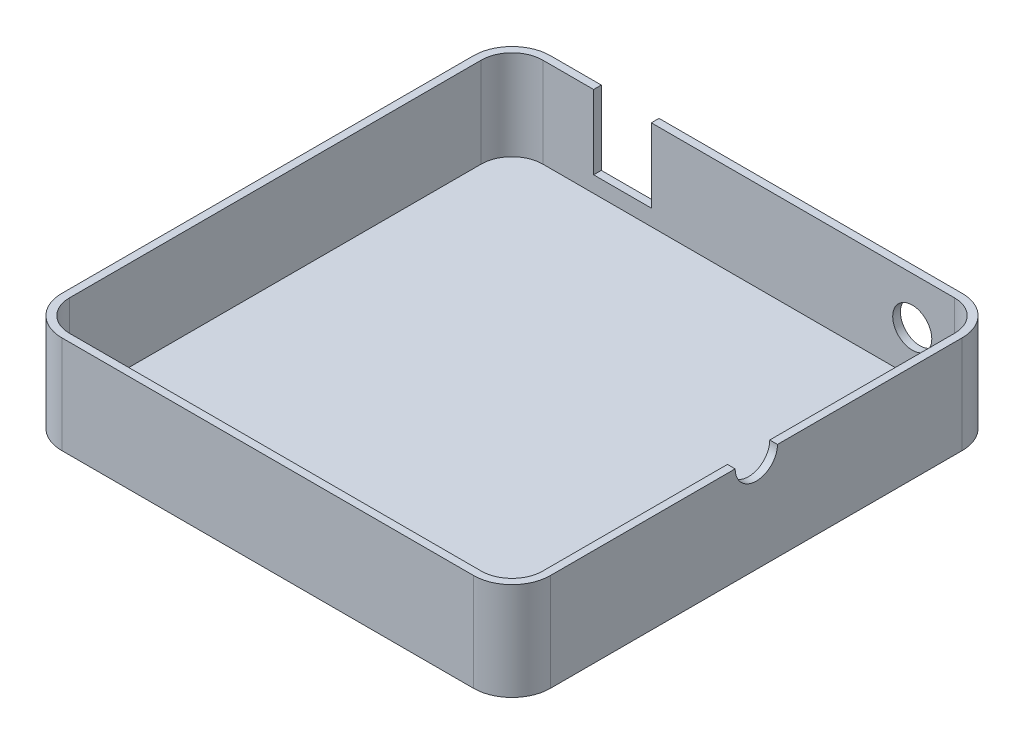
ISO-10303-21;
HEADER;
FILE_DESCRIPTION(('STEP AP214'),'2;1');
FILE_NAME('part.step','',(''),(''),'','','');
FILE_SCHEMA(('AUTOMOTIVE_DESIGN { 1 0 10303 214 1 1 1 1 }'));
ENDSEC;
DATA;
#1=APPLICATION_CONTEXT('core data for automotive mechanical design processes');
#2=APPLICATION_PROTOCOL_DEFINITION('international standard','automotive_design',2000,#1);
#3=PRODUCT_CONTEXT('',#1,'mechanical');
#4=PRODUCT('Part','Part','',(#3));
#5=PRODUCT_RELATED_PRODUCT_CATEGORY('part','',(#4));
#6=PRODUCT_DEFINITION_FORMATION('','',#4);
#7=PRODUCT_DEFINITION_CONTEXT('part definition',#1,'design');
#8=PRODUCT_DEFINITION('design','',#6,#7);
#9=PRODUCT_DEFINITION_SHAPE('','',#8);
#10=(LENGTH_UNIT() NAMED_UNIT(*) SI_UNIT(.MILLI.,.METRE.));
#11=(NAMED_UNIT(*) PLANE_ANGLE_UNIT() SI_UNIT($,.RADIAN.));
#12=(NAMED_UNIT(*) SI_UNIT($,.STERADIAN.) SOLID_ANGLE_UNIT());
#13=UNCERTAINTY_MEASURE_WITH_UNIT(LENGTH_MEASURE(1.E-05),#10,'distance_accuracy_value','');
#14=(GEOMETRIC_REPRESENTATION_CONTEXT(3) GLOBAL_UNCERTAINTY_ASSIGNED_CONTEXT((#13)) GLOBAL_UNIT_ASSIGNED_CONTEXT((#10,
#11,#12)) REPRESENTATION_CONTEXT('',''));
#15=CARTESIAN_POINT('',(0.,0.,0.));
#16=DIRECTION('',(0.,0.,1.));
#17=DIRECTION('',(1.,0.,0.));
#18=AXIS2_PLACEMENT_3D('',#15,#16,#17);
#19=CARTESIAN_POINT('',(0.,0.,127.));
#20=DIRECTION('',(0.,-1.,0.));
#21=DIRECTION('',(0.,0.,-1.));
#22=AXIS2_PLACEMENT_3D('',#19,#20,#21);
#23=PLANE('',#22);
#24=DIRECTION('',(-1.,0.,0.));
#25=VECTOR('',#24,1.);
#26=CARTESIAN_POINT('',(0.,0.,2.));
#27=LINE('',#26,#25);
#28=CARTESIAN_POINT('',(23.214826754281,0.,2.));
#29=VERTEX_POINT('',#28);
#30=CARTESIAN_POINT('',(10.,0.,2.));
#31=VERTEX_POINT('',#30);
#32=EDGE_CURVE('E203',#29,#31,#27,.T.);
#33=ORIENTED_EDGE('',*,*,#32,.F.);
#34=DIRECTION('',(0.,0.,1.));
#35=VECTOR('',#34,1.);
#36=CARTESIAN_POINT('',(23.214826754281,0.,127.001));
#37=LINE('',#36,#35);
#38=CARTESIAN_POINT('',(23.214826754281,0.,0.));
#39=VERTEX_POINT('',#38);
#40=EDGE_CURVE('E188',#39,#29,#37,.T.);
#41=ORIENTED_EDGE('',*,*,#40,.F.);
#42=DIRECTION('',(-1.,0.,0.));
#43=VECTOR('',#42,1.);
#44=CARTESIAN_POINT('',(0.,0.,0.));
#45=LINE('',#44,#43);
#46=CARTESIAN_POINT('',(10.,0.,0.));
#47=VERTEX_POINT('',#46);
#48=EDGE_CURVE('E200',#39,#47,#45,.T.);
#49=ORIENTED_EDGE('',*,*,#48,.T.);
#50=CARTESIAN_POINT('',(10.,0.,9.99999999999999));
#51=DIRECTION('',(0.,-1.,0.));
#52=DIRECTION('',(0.,0.,-1.));
#53=AXIS2_PLACEMENT_3D('',#50,#51,#52);
#54=CIRCLE('',#53,10.);
#55=CARTESIAN_POINT('',(0.,0.,9.99999999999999));
#56=VERTEX_POINT('',#55);
#57=EDGE_CURVE('E254',#47,#56,#54,.F.);
#58=ORIENTED_EDGE('',*,*,#57,.T.);
#59=DIRECTION('',(0.,0.,-1.));
#60=VECTOR('',#59,1.);
#61=CARTESIAN_POINT('',(0.,0.,127.));
#62=LINE('',#61,#60);
#63=CARTESIAN_POINT('',(0.,0.,117.));
#64=VERTEX_POINT('',#63);
#65=EDGE_CURVE('E221',#64,#56,#62,.T.);
#66=ORIENTED_EDGE('',*,*,#65,.F.);
#67=CARTESIAN_POINT('',(10.,0.,117.));
#68=DIRECTION('',(0.,-1.,0.));
#69=DIRECTION('',(0.,0.,-1.));
#70=AXIS2_PLACEMENT_3D('',#67,#68,#69);
#71=CIRCLE('',#70,10.);
#72=CARTESIAN_POINT('',(10.,0.,127.));
#73=VERTEX_POINT('',#72);
#74=EDGE_CURVE('E260',#64,#73,#71,.F.);
#75=ORIENTED_EDGE('',*,*,#74,.T.);
#76=DIRECTION('',(-1.,0.,0.));
#77=VECTOR('',#76,1.);
#78=CARTESIAN_POINT('',(0.,0.,127.));
#79=LINE('',#78,#77);
#80=CARTESIAN_POINT('',(117.,0.,127.));
#81=VERTEX_POINT('',#80);
#82=EDGE_CURVE('E225',#81,#73,#79,.T.);
#83=ORIENTED_EDGE('',*,*,#82,.F.);
#84=CARTESIAN_POINT('',(117.,0.,117.));
#85=DIRECTION('',(0.,-1.,0.));
#86=DIRECTION('',(0.,0.,-1.));
#87=AXIS2_PLACEMENT_3D('',#84,#85,#86);
#88=CIRCLE('',#87,10.);
#89=CARTESIAN_POINT('',(127.,0.,117.));
#90=VERTEX_POINT('',#89);
#91=EDGE_CURVE('E258',#81,#90,#88,.F.);
#92=ORIENTED_EDGE('',*,*,#91,.T.);
#93=DIRECTION('',(0.,0.,-1.));
#94=VECTOR('',#93,1.);
#95=CARTESIAN_POINT('',(127.,0.,127.));
#96=LINE('',#95,#94);
#97=CARTESIAN_POINT('',(127.,0.,69.));
#98=VERTEX_POINT('',#97);
#99=EDGE_CURVE('E226',#90,#98,#96,.T.);
#100=ORIENTED_EDGE('',*,*,#99,.T.);
#101=DIRECTION('',(1.,0.,0.));
#102=VECTOR('',#101,1.);
#103=CARTESIAN_POINT('',(123.,0.,69.));
#104=LINE('',#103,#102);
#105=CARTESIAN_POINT('',(125.,0.,69.));
#106=VERTEX_POINT('',#105);
#107=EDGE_CURVE('E419',#98,#106,#104,.F.);
#108=ORIENTED_EDGE('',*,*,#107,.T.);
#109=DIRECTION('',(0.,0.,-1.));
#110=VECTOR('',#109,1.);
#111=CARTESIAN_POINT('',(125.,0.,127.));
#112=LINE('',#111,#110);
#113=CARTESIAN_POINT('',(125.,0.,117.));
#114=VERTEX_POINT('',#113);
#115=EDGE_CURVE('E368',#114,#106,#112,.T.);
#116=ORIENTED_EDGE('',*,*,#115,.F.);
#117=CARTESIAN_POINT('',(117.,0.,117.));
#118=DIRECTION('',(0.,-1.,0.));
#119=DIRECTION('',(0.,0.,-1.));
#120=AXIS2_PLACEMENT_3D('',#117,#118,#119);
#121=CIRCLE('',#120,8.);
#122=CARTESIAN_POINT('',(117.,0.,125.));
#123=VERTEX_POINT('',#122);
#124=EDGE_CURVE('E367',#123,#114,#121,.F.);
#125=ORIENTED_EDGE('',*,*,#124,.F.);
#126=DIRECTION('',(-1.,0.,0.));
#127=VECTOR('',#126,1.);
#128=CARTESIAN_POINT('',(0.,0.,125.));
#129=LINE('',#128,#127);
#130=CARTESIAN_POINT('',(10.,0.,125.));
#131=VERTEX_POINT('',#130);
#132=EDGE_CURVE('E375',#123,#131,#129,.T.);
#133=ORIENTED_EDGE('',*,*,#132,.T.);
#134=CARTESIAN_POINT('',(10.,0.,117.));
#135=DIRECTION('',(0.,-1.,0.));
#136=DIRECTION('',(0.,0.,-1.));
#137=AXIS2_PLACEMENT_3D('',#134,#135,#136);
#138=CIRCLE('',#137,8.);
#139=CARTESIAN_POINT('',(2.,0.,117.));
#140=VERTEX_POINT('',#139);
#141=EDGE_CURVE('E374',#140,#131,#138,.F.);
#142=ORIENTED_EDGE('',*,*,#141,.F.);
#143=DIRECTION('',(0.,0.,-1.));
#144=VECTOR('',#143,1.);
#145=CARTESIAN_POINT('',(2.,0.,127.));
#146=LINE('',#145,#144);
#147=CARTESIAN_POINT('',(2.,0.,9.99999999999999));
#148=VERTEX_POINT('',#147);
#149=EDGE_CURVE('E378',#140,#148,#146,.T.);
#150=ORIENTED_EDGE('',*,*,#149,.T.);
#151=CARTESIAN_POINT('',(10.,0.,9.99999999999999));
#152=DIRECTION('',(0.,-1.,0.));
#153=DIRECTION('',(0.,0.,-1.));
#154=AXIS2_PLACEMENT_3D('',#151,#152,#153);
#155=CIRCLE('',#154,8.);
#156=EDGE_CURVE('E359',#31,#148,#155,.F.);
#157=ORIENTED_EDGE('',*,*,#156,.F.);
#158=EDGE_LOOP('',(#33,#41,#49,#58,#66,#75,#83,#92,#100,#108,#116,#125,#133,#142,#150,#157));
#159=FACE_BOUND('',#158,.T.);
#160=ADVANCED_FACE('F37',(#159),#23,.F.);
#161=CARTESIAN_POINT('',(0.,0.,127.));
#162=DIRECTION('',(1.,0.,0.));
#163=DIRECTION('',(0.,1.,0.));
#164=AXIS2_PLACEMENT_3D('',#161,#162,#163);
#165=PLANE('',#164);
#166=CARTESIAN_POINT('',(0.,-12.7181438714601,55.0759828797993));
#167=DIRECTION('',(1.,0.,0.));
#168=DIRECTION('',(0.,1.,0.));
#169=AXIS2_PLACEMENT_3D('',#166,#167,#168);
#170=CIRCLE('',#169,6.);
#171=CARTESIAN_POINT('',(0.,-6.71814387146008,55.0759828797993));
#172=VERTEX_POINT('',#171);
#173=EDGE_CURVE('E45',#172,#172,#170,.F.);
#174=ORIENTED_EDGE('',*,*,#173,.F.);
#175=EDGE_LOOP('',(#174));
#176=FACE_BOUND('',#175,.T.);
#177=DIRECTION('',(0.,0.,-1.));
#178=VECTOR('',#177,1.);
#179=CARTESIAN_POINT('',(0.,-25.4,127.));
#180=LINE('',#179,#178);
#181=CARTESIAN_POINT('',(0.,-25.4,117.));
#182=VERTEX_POINT('',#181);
#183=CARTESIAN_POINT('',(0.,-25.4,9.99999999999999));
#184=VERTEX_POINT('',#183);
#185=EDGE_CURVE('E232',#182,#184,#180,.T.);
#186=ORIENTED_EDGE('',*,*,#185,.F.);
#187=DIRECTION('',(0.,-1.,0.));
#188=VECTOR('',#187,1.);
#189=CARTESIAN_POINT('',(0.,0.,117.));
#190=LINE('',#189,#188);
#191=EDGE_CURVE('E252',#182,#64,#190,.F.);
#192=ORIENTED_EDGE('',*,*,#191,.T.);
#193=ORIENTED_EDGE('',*,*,#65,.T.);
#194=DIRECTION('',(0.,-1.,0.));
#195=VECTOR('',#194,1.);
#196=CARTESIAN_POINT('',(0.,0.,9.99999999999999));
#197=LINE('',#196,#195);
#198=EDGE_CURVE('E249',#56,#184,#197,.T.);
#199=ORIENTED_EDGE('',*,*,#198,.T.);
#200=EDGE_LOOP('',(#186,#192,#193,#199));
#201=FACE_BOUND('',#200,.T.);
#202=CARTESIAN_POINT('',(0.,-12.7181438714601,28.6253660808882));
#203=DIRECTION('',(1.,0.,0.));
#204=DIRECTION('',(0.,1.,0.));
#205=AXIS2_PLACEMENT_3D('',#202,#203,#204);
#206=CIRCLE('',#205,6.);
#207=CARTESIAN_POINT('',(0.,-6.71814387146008,28.6253660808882));
#208=VERTEX_POINT('',#207);
#209=EDGE_CURVE('E272',#208,#208,#206,.F.);
#210=ORIENTED_EDGE('',*,*,#209,.F.);
#211=EDGE_LOOP('',(#210));
#212=FACE_BOUND('',#211,.T.);
#213=CARTESIAN_POINT('',(0.,-12.7181438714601,84.9919750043));
#214=DIRECTION('',(1.,0.,0.));
#215=DIRECTION('',(0.,1.,0.));
#216=AXIS2_PLACEMENT_3D('',#213,#214,#215);
#217=CIRCLE('',#216,6.);
#218=CARTESIAN_POINT('',(0.,-6.71814387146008,84.9919750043));
#219=VERTEX_POINT('',#218);
#220=EDGE_CURVE('E11',#219,#219,#217,.F.);
#221=ORIENTED_EDGE('',*,*,#220,.F.);
#222=EDGE_LOOP('',(#221));
#223=FACE_BOUND('',#222,.T.);
#224=ADVANCED_FACE('F284',(#176,#201,#212,#223),#165,.F.);
#225=CARTESIAN_POINT('',(0.,-25.4,127.));
#226=DIRECTION('',(0.,1.,0.));
#227=DIRECTION('',(0.,0.,1.));
#228=AXIS2_PLACEMENT_3D('',#225,#226,#227);
#229=PLANE('',#228);
#230=DIRECTION('',(1.,0.,0.));
#231=VECTOR('',#230,1.);
#232=CARTESIAN_POINT('',(0.,-25.4,127.));
#233=LINE('',#232,#231);
#234=CARTESIAN_POINT('',(10.,-25.4,127.));
#235=VERTEX_POINT('',#234);
#236=CARTESIAN_POINT('',(117.,-25.4,127.));
#237=VERTEX_POINT('',#236);
#238=EDGE_CURVE('E215',#235,#237,#233,.T.);
#239=ORIENTED_EDGE('',*,*,#238,.F.);
#240=CARTESIAN_POINT('',(10.,-25.4,117.));
#241=DIRECTION('',(0.,1.,0.));
#242=DIRECTION('',(0.,0.,1.));
#243=AXIS2_PLACEMENT_3D('',#240,#241,#242);
#244=CIRCLE('',#243,10.);
#245=EDGE_CURVE('E247',#235,#182,#244,.F.);
#246=ORIENTED_EDGE('',*,*,#245,.T.);
#247=ORIENTED_EDGE('',*,*,#185,.T.);
#248=CARTESIAN_POINT('',(10.,-25.4,9.99999999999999));
#249=DIRECTION('',(0.,1.,0.));
#250=DIRECTION('',(0.,0.,1.));
#251=AXIS2_PLACEMENT_3D('',#248,#249,#250);
#252=CIRCLE('',#251,10.);
#253=CARTESIAN_POINT('',(10.,-25.4,0.));
#254=VERTEX_POINT('',#253);
#255=EDGE_CURVE('E241',#184,#254,#252,.F.);
#256=ORIENTED_EDGE('',*,*,#255,.T.);
#257=DIRECTION('',(1.,0.,0.));
#258=VECTOR('',#257,1.);
#259=CARTESIAN_POINT('',(0.,-25.4,0.));
#260=LINE('',#259,#258);
#261=CARTESIAN_POINT('',(117.,-25.4,0.));
#262=VERTEX_POINT('',#261);
#263=EDGE_CURVE('E212',#254,#262,#260,.T.);
#264=ORIENTED_EDGE('',*,*,#263,.T.);
#265=CARTESIAN_POINT('',(117.,-25.4,9.99999999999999));
#266=DIRECTION('',(0.,1.,0.));
#267=DIRECTION('',(0.,0.,1.));
#268=AXIS2_PLACEMENT_3D('',#265,#266,#267);
#269=CIRCLE('',#268,10.);
#270=CARTESIAN_POINT('',(127.,-25.4,9.99999999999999));
#271=VERTEX_POINT('',#270);
#272=EDGE_CURVE('E243',#262,#271,#269,.F.);
#273=ORIENTED_EDGE('',*,*,#272,.T.);
#274=DIRECTION('',(0.,0.,-1.));
#275=VECTOR('',#274,1.);
#276=CARTESIAN_POINT('',(127.,-25.4,127.));
#277=LINE('',#276,#275);
#278=CARTESIAN_POINT('',(127.,-25.4,117.));
#279=VERTEX_POINT('',#278);
#280=EDGE_CURVE('E229',#279,#271,#277,.T.);
#281=ORIENTED_EDGE('',*,*,#280,.F.);
#282=CARTESIAN_POINT('',(117.,-25.4,117.));
#283=DIRECTION('',(0.,1.,0.));
#284=DIRECTION('',(0.,0.,1.));
#285=AXIS2_PLACEMENT_3D('',#282,#283,#284);
#286=CIRCLE('',#285,10.);
#287=EDGE_CURVE('E245',#279,#237,#286,.F.);
#288=ORIENTED_EDGE('',*,*,#287,.T.);
#289=EDGE_LOOP('',(#239,#246,#247,#256,#264,#273,#281,#288));
#290=FACE_BOUND('',#289,.T.);
#291=ADVANCED_FACE('F287',(#290),#229,.F.);
#292=CARTESIAN_POINT('',(127.,0.,127.));
#293=DIRECTION('',(-1.,0.,0.));
#294=DIRECTION('',(0.,0.,1.));
#295=AXIS2_PLACEMENT_3D('',#292,#293,#294);
#296=PLANE('',#295);
#297=CARTESIAN_POINT('',(127.,0.,58.));
#298=VERTEX_POINT('',#297);
#299=CARTESIAN_POINT('',(127.,0.,9.99999999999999));
#300=VERTEX_POINT('',#299);
#301=EDGE_CURVE('E224',#298,#300,#96,.T.);
#302=ORIENTED_EDGE('',*,*,#301,.F.);
#303=CARTESIAN_POINT('',(127.,0.,63.5));
#304=DIRECTION('',(1.,0.,0.));
#305=DIRECTION('',(0.,0.,-1.));
#306=AXIS2_PLACEMENT_3D('',#303,#304,#305);
#307=CIRCLE('',#306,5.5);
#308=EDGE_CURVE('E276',#98,#298,#307,.T.);
#309=ORIENTED_EDGE('',*,*,#308,.F.);
#310=ORIENTED_EDGE('',*,*,#99,.F.);
#311=DIRECTION('',(0.,1.,0.));
#312=VECTOR('',#311,1.);
#313=CARTESIAN_POINT('',(127.,-25.4,117.));
#314=LINE('',#313,#312);
#315=EDGE_CURVE('E265',#90,#279,#314,.F.);
#316=ORIENTED_EDGE('',*,*,#315,.T.);
#317=ORIENTED_EDGE('',*,*,#280,.T.);
#318=DIRECTION('',(0.,1.,0.));
#319=VECTOR('',#318,1.);
#320=CARTESIAN_POINT('',(127.,0.,9.99999999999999));
#321=LINE('',#320,#319);
#322=EDGE_CURVE('E262',#271,#300,#321,.T.);
#323=ORIENTED_EDGE('',*,*,#322,.T.);
#324=EDGE_LOOP('',(#302,#309,#310,#316,#317,#323));
#325=FACE_BOUND('',#324,.T.);
#326=ADVANCED_FACE('F321',(#325),#296,.F.);
#327=CARTESIAN_POINT('',(117.,0.,0.));
#328=VERTEX_POINT('',#327);
#329=CARTESIAN_POINT('',(38.214826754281,0.,0.));
#330=VERTEX_POINT('',#329);
#331=EDGE_CURVE('E211',#328,#330,#45,.T.);
#332=ORIENTED_EDGE('',*,*,#331,.T.);
#333=DIRECTION('',(0.,0.,-1.));
#334=VECTOR('',#333,1.);
#335=CARTESIAN_POINT('',(38.214826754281,0.,127.001));
#336=LINE('',#335,#334);
#337=CARTESIAN_POINT('',(38.214826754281,0.,2.));
#338=VERTEX_POINT('',#337);
#339=EDGE_CURVE('E204',#338,#330,#336,.T.);
#340=ORIENTED_EDGE('',*,*,#339,.F.);
#341=CARTESIAN_POINT('',(117.,0.,2.));
#342=VERTEX_POINT('',#341);
#343=EDGE_CURVE('E363',#342,#338,#27,.T.);
#344=ORIENTED_EDGE('',*,*,#343,.F.);
#345=CARTESIAN_POINT('',(117.,0.,9.99999999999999));
#346=DIRECTION('',(0.,-1.,0.));
#347=DIRECTION('',(0.,0.,-1.));
#348=AXIS2_PLACEMENT_3D('',#345,#346,#347);
#349=CIRCLE('',#348,8.);
#350=CARTESIAN_POINT('',(125.,0.,9.99999999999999));
#351=VERTEX_POINT('',#350);
#352=EDGE_CURVE('E361',#351,#342,#349,.F.);
#353=ORIENTED_EDGE('',*,*,#352,.F.);
#354=CARTESIAN_POINT('',(125.,0.,58.));
#355=VERTEX_POINT('',#354);
#356=EDGE_CURVE('E372',#355,#351,#112,.T.);
#357=ORIENTED_EDGE('',*,*,#356,.F.);
#358=DIRECTION('',(1.,0.,0.));
#359=VECTOR('',#358,1.);
#360=CARTESIAN_POINT('',(123.,0.,58.));
#361=LINE('',#360,#359);
#362=EDGE_CURVE('E60',#355,#298,#361,.T.);
#363=ORIENTED_EDGE('',*,*,#362,.T.);
#364=ORIENTED_EDGE('',*,*,#301,.T.);
#365=CARTESIAN_POINT('',(117.,0.,9.99999999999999));
#366=DIRECTION('',(0.,-1.,0.));
#367=DIRECTION('',(0.,0.,-1.));
#368=AXIS2_PLACEMENT_3D('',#365,#366,#367);
#369=CIRCLE('',#368,10.);
#370=EDGE_CURVE('E256',#300,#328,#369,.F.);
#371=ORIENTED_EDGE('',*,*,#370,.T.);
#372=EDGE_LOOP('',(#332,#340,#344,#353,#357,#363,#364,#371));
#373=FACE_BOUND('',#372,.T.);
#374=ADVANCED_FACE('F314',(#373),#23,.F.);
#375=CARTESIAN_POINT('',(0.,0.,127.));
#376=DIRECTION('',(0.,0.,1.));
#377=DIRECTION('',(1.,0.,0.));
#378=AXIS2_PLACEMENT_3D('',#375,#376,#377);
#379=PLANE('',#378);
#380=ORIENTED_EDGE('',*,*,#82,.T.);
#381=DIRECTION('',(0.,-1.,0.));
#382=VECTOR('',#381,1.);
#383=CARTESIAN_POINT('',(10.,-25.4,127.));
#384=LINE('',#383,#382);
#385=EDGE_CURVE('E238',#73,#235,#384,.T.);
#386=ORIENTED_EDGE('',*,*,#385,.T.);
#387=ORIENTED_EDGE('',*,*,#238,.T.);
#388=DIRECTION('',(0.,1.,0.));
#389=VECTOR('',#388,1.);
#390=CARTESIAN_POINT('',(117.,0.,127.));
#391=LINE('',#390,#389);
#392=EDGE_CURVE('E235',#237,#81,#391,.T.);
#393=ORIENTED_EDGE('',*,*,#392,.T.);
#394=EDGE_LOOP('',(#380,#386,#387,#393));
#395=FACE_BOUND('',#394,.T.);
#396=ADVANCED_FACE('F320',(#395),#379,.T.);
#397=CARTESIAN_POINT('',(0.,0.,0.));
#398=DIRECTION('',(0.,0.,1.));
#399=DIRECTION('',(1.,0.,0.));
#400=AXIS2_PLACEMENT_3D('',#397,#398,#399);
#401=PLANE('',#400);
#402=CARTESIAN_POINT('',(106.025738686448,-12.20045175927,0.));
#403=DIRECTION('',(0.,0.,-1.));
#404=DIRECTION('',(-1.,0.,0.));
#405=AXIS2_PLACEMENT_3D('',#402,#403,#404);
#406=CIRCLE('',#405,5.08);
#407=CARTESIAN_POINT('',(100.945738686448,-12.20045175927,0.));
#408=VERTEX_POINT('',#407);
#409=EDGE_CURVE('E277',#408,#408,#406,.T.);
#410=ORIENTED_EDGE('',*,*,#409,.F.);
#411=EDGE_LOOP('',(#410));
#412=FACE_BOUND('',#411,.T.);
#413=ORIENTED_EDGE('',*,*,#48,.F.);
#414=DIRECTION('',(0.,1.,0.));
#415=VECTOR('',#414,1.);
#416=CARTESIAN_POINT('',(23.214826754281,-19.2075234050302,0.));
#417=LINE('',#416,#415);
#418=CARTESIAN_POINT('',(23.214826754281,-19.2075234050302,0.));
#419=VERTEX_POINT('',#418);
#420=EDGE_CURVE('E185',#419,#39,#417,.T.);
#421=ORIENTED_EDGE('',*,*,#420,.F.);
#422=DIRECTION('',(-1.,0.,0.));
#423=VECTOR('',#422,1.);
#424=CARTESIAN_POINT('',(38.214826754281,-19.2075234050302,0.));
#425=LINE('',#424,#423);
#426=CARTESIAN_POINT('',(38.214826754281,-19.2075234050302,0.));
#427=VERTEX_POINT('',#426);
#428=EDGE_CURVE('E196',#427,#419,#425,.T.);
#429=ORIENTED_EDGE('',*,*,#428,.F.);
#430=DIRECTION('',(0.,-1.,0.));
#431=VECTOR('',#430,1.);
#432=CARTESIAN_POINT('',(38.214826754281,-19.2075234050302,0.));
#433=LINE('',#432,#431);
#434=EDGE_CURVE('E337',#330,#427,#433,.T.);
#435=ORIENTED_EDGE('',*,*,#434,.F.);
#436=ORIENTED_EDGE('',*,*,#331,.F.);
#437=DIRECTION('',(0.,1.,0.));
#438=VECTOR('',#437,1.);
#439=CARTESIAN_POINT('',(117.,0.,0.));
#440=LINE('',#439,#438);
#441=EDGE_CURVE('E268',#328,#262,#440,.F.);
#442=ORIENTED_EDGE('',*,*,#441,.T.);
#443=ORIENTED_EDGE('',*,*,#263,.F.);
#444=DIRECTION('',(0.,-1.,0.));
#445=VECTOR('',#444,1.);
#446=CARTESIAN_POINT('',(10.,0.,0.));
#447=LINE('',#446,#445);
#448=EDGE_CURVE('E209',#254,#47,#447,.F.);
#449=ORIENTED_EDGE('',*,*,#448,.T.);
#450=EDGE_LOOP('',(#413,#421,#429,#435,#436,#442,#443,#449));
#451=FACE_BOUND('',#450,.T.);
#452=ADVANCED_FACE('F206',(#412,#451),#401,.F.);
#453=CARTESIAN_POINT('',(10.,0.,117.));
#454=DIRECTION('',(0.,1.,0.));
#455=DIRECTION('',(-1.,0.,0.));
#456=AXIS2_PLACEMENT_3D('',#453,#454,#455);
#457=CYLINDRICAL_SURFACE('',#456,10.);
#458=ORIENTED_EDGE('',*,*,#74,.F.);
#459=ORIENTED_EDGE('',*,*,#191,.F.);
#460=ORIENTED_EDGE('',*,*,#245,.F.);
#461=ORIENTED_EDGE('',*,*,#385,.F.);
#462=EDGE_LOOP('',(#458,#459,#460,#461));
#463=FACE_BOUND('',#462,.T.);
#464=ADVANCED_FACE('F468',(#463),#457,.T.);
#465=CARTESIAN_POINT('',(117.,0.,117.));
#466=DIRECTION('',(0.,-1.,0.));
#467=DIRECTION('',(0.,0.,-1.));
#468=AXIS2_PLACEMENT_3D('',#465,#466,#467);
#469=CYLINDRICAL_SURFACE('',#468,10.);
#470=ORIENTED_EDGE('',*,*,#287,.F.);
#471=ORIENTED_EDGE('',*,*,#315,.F.);
#472=ORIENTED_EDGE('',*,*,#91,.F.);
#473=ORIENTED_EDGE('',*,*,#392,.F.);
#474=EDGE_LOOP('',(#470,#471,#472,#473));
#475=FACE_BOUND('',#474,.T.);
#476=ADVANCED_FACE('F351',(#475),#469,.T.);
#477=CARTESIAN_POINT('',(117.,0.,9.99999999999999));
#478=DIRECTION('',(0.,1.,0.));
#479=DIRECTION('',(0.,0.,1.));
#480=AXIS2_PLACEMENT_3D('',#477,#478,#479);
#481=CYLINDRICAL_SURFACE('',#480,10.);
#482=ORIENTED_EDGE('',*,*,#272,.F.);
#483=ORIENTED_EDGE('',*,*,#441,.F.);
#484=ORIENTED_EDGE('',*,*,#370,.F.);
#485=ORIENTED_EDGE('',*,*,#322,.F.);
#486=EDGE_LOOP('',(#482,#483,#484,#485));
#487=FACE_BOUND('',#486,.T.);
#488=ADVANCED_FACE('F340',(#487),#481,.T.);
#489=CARTESIAN_POINT('',(10.,0.,9.99999999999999));
#490=DIRECTION('',(0.,-1.,0.));
#491=DIRECTION('',(1.,0.,0.));
#492=AXIS2_PLACEMENT_3D('',#489,#490,#491);
#493=CYLINDRICAL_SURFACE('',#492,10.);
#494=ORIENTED_EDGE('',*,*,#57,.F.);
#495=ORIENTED_EDGE('',*,*,#448,.F.);
#496=ORIENTED_EDGE('',*,*,#255,.F.);
#497=ORIENTED_EDGE('',*,*,#198,.F.);
#498=EDGE_LOOP('',(#494,#495,#496,#497));
#499=FACE_BOUND('',#498,.T.);
#500=ADVANCED_FACE('F39',(#499),#493,.T.);
#501=CARTESIAN_POINT('',(2.,0.,127.));
#502=DIRECTION('',(1.,0.,0.));
#503=DIRECTION('',(0.,1.,0.));
#504=AXIS2_PLACEMENT_3D('',#501,#502,#503);
#505=PLANE('',#504);
#506=DIRECTION('',(0.,0.,-1.));
#507=VECTOR('',#506,1.);
#508=CARTESIAN_POINT('',(2.,-23.4,127.));
#509=LINE('',#508,#507);
#510=CARTESIAN_POINT('',(2.,-23.4,117.));
#511=VERTEX_POINT('',#510);
#512=CARTESIAN_POINT('',(2.,-23.4,9.99999999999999));
#513=VERTEX_POINT('',#512);
#514=EDGE_CURVE('E394',#511,#513,#509,.T.);
#515=ORIENTED_EDGE('',*,*,#514,.T.);
#516=DIRECTION('',(0.,1.,0.));
#517=VECTOR('',#516,1.);
#518=CARTESIAN_POINT('',(2.,0.,9.99999999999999));
#519=LINE('',#518,#517);
#520=EDGE_CURVE('E410',#148,#513,#519,.F.);
#521=ORIENTED_EDGE('',*,*,#520,.F.);
#522=ORIENTED_EDGE('',*,*,#149,.F.);
#523=DIRECTION('',(0.,1.,0.));
#524=VECTOR('',#523,1.);
#525=CARTESIAN_POINT('',(2.,0.,117.));
#526=LINE('',#525,#524);
#527=EDGE_CURVE('E362',#511,#140,#526,.T.);
#528=ORIENTED_EDGE('',*,*,#527,.F.);
#529=EDGE_LOOP('',(#515,#521,#522,#528));
#530=FACE_BOUND('',#529,.T.);
#531=ADVANCED_FACE('F472',(#530),#505,.T.);
#532=CARTESIAN_POINT('',(0.,-23.4,127.));
#533=DIRECTION('',(0.,1.,0.));
#534=DIRECTION('',(0.,0.,1.));
#535=AXIS2_PLACEMENT_3D('',#532,#533,#534);
#536=PLANE('',#535);
#537=DIRECTION('',(1.,0.,0.));
#538=VECTOR('',#537,1.);
#539=CARTESIAN_POINT('',(0.,-23.4,125.));
#540=LINE('',#539,#538);
#541=CARTESIAN_POINT('',(10.,-23.4,125.));
#542=VERTEX_POINT('',#541);
#543=CARTESIAN_POINT('',(117.,-23.4,125.));
#544=VERTEX_POINT('',#543);
#545=EDGE_CURVE('E365',#542,#544,#540,.T.);
#546=ORIENTED_EDGE('',*,*,#545,.T.);
#547=CARTESIAN_POINT('',(117.,-23.4,117.));
#548=DIRECTION('',(0.,1.,0.));
#549=DIRECTION('',(0.,0.,1.));
#550=AXIS2_PLACEMENT_3D('',#547,#548,#549);
#551=CIRCLE('',#550,8.);
#552=CARTESIAN_POINT('',(125.,-23.4,117.));
#553=VERTEX_POINT('',#552);
#554=EDGE_CURVE('E398',#553,#544,#551,.F.);
#555=ORIENTED_EDGE('',*,*,#554,.F.);
#556=DIRECTION('',(0.,0.,-1.));
#557=VECTOR('',#556,1.);
#558=CARTESIAN_POINT('',(125.,-23.4,127.));
#559=LINE('',#558,#557);
#560=CARTESIAN_POINT('',(125.,-23.4,9.99999999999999));
#561=VERTEX_POINT('',#560);
#562=EDGE_CURVE('E371',#553,#561,#559,.T.);
#563=ORIENTED_EDGE('',*,*,#562,.T.);
#564=CARTESIAN_POINT('',(117.,-23.4,9.99999999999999));
#565=DIRECTION('',(0.,1.,0.));
#566=DIRECTION('',(0.,0.,1.));
#567=AXIS2_PLACEMENT_3D('',#564,#565,#566);
#568=CIRCLE('',#567,8.);
#569=CARTESIAN_POINT('',(117.,-23.4,2.));
#570=VERTEX_POINT('',#569);
#571=EDGE_CURVE('E401',#570,#561,#568,.F.);
#572=ORIENTED_EDGE('',*,*,#571,.F.);
#573=DIRECTION('',(1.,0.,0.));
#574=VECTOR('',#573,1.);
#575=CARTESIAN_POINT('',(0.,-23.4,2.));
#576=LINE('',#575,#574);
#577=CARTESIAN_POINT('',(10.,-23.4,2.));
#578=VERTEX_POINT('',#577);
#579=EDGE_CURVE('E405',#578,#570,#576,.T.);
#580=ORIENTED_EDGE('',*,*,#579,.F.);
#581=CARTESIAN_POINT('',(10.,-23.4,9.99999999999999));
#582=DIRECTION('',(0.,1.,0.));
#583=DIRECTION('',(0.,0.,1.));
#584=AXIS2_PLACEMENT_3D('',#581,#582,#583);
#585=CIRCLE('',#584,8.);
#586=EDGE_CURVE('E391',#513,#578,#585,.F.);
#587=ORIENTED_EDGE('',*,*,#586,.F.);
#588=ORIENTED_EDGE('',*,*,#514,.F.);
#589=CARTESIAN_POINT('',(10.,-23.4,117.));
#590=DIRECTION('',(0.,1.,0.));
#591=DIRECTION('',(0.,0.,1.));
#592=AXIS2_PLACEMENT_3D('',#589,#590,#591);
#593=CIRCLE('',#592,8.);
#594=EDGE_CURVE('E400',#542,#511,#593,.F.);
#595=ORIENTED_EDGE('',*,*,#594,.F.);
#596=EDGE_LOOP('',(#546,#555,#563,#572,#580,#587,#588,#595));
#597=FACE_BOUND('',#596,.T.);
#598=ADVANCED_FACE('F477',(#597),#536,.T.);
#599=CARTESIAN_POINT('',(125.,0.,127.));
#600=DIRECTION('',(-1.,0.,0.));
#601=DIRECTION('',(0.,0.,1.));
#602=AXIS2_PLACEMENT_3D('',#599,#600,#601);
#603=PLANE('',#602);
#604=CARTESIAN_POINT('',(125.,0.,63.5));
#605=DIRECTION('',(-1.,0.,0.));
#606=DIRECTION('',(0.,0.,1.));
#607=AXIS2_PLACEMENT_3D('',#604,#605,#606);
#608=CIRCLE('',#607,5.5);
#609=EDGE_CURVE('E270',#355,#106,#608,.T.);
#610=ORIENTED_EDGE('',*,*,#609,.F.);
#611=ORIENTED_EDGE('',*,*,#356,.T.);
#612=DIRECTION('',(0.,1.,0.));
#613=VECTOR('',#612,1.);
#614=CARTESIAN_POINT('',(125.,0.,9.99999999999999));
#615=LINE('',#614,#613);
#616=EDGE_CURVE('E380',#561,#351,#615,.T.);
#617=ORIENTED_EDGE('',*,*,#616,.F.);
#618=ORIENTED_EDGE('',*,*,#562,.F.);
#619=DIRECTION('',(0.,1.,0.));
#620=VECTOR('',#619,1.);
#621=CARTESIAN_POINT('',(125.,0.,117.));
#622=LINE('',#621,#620);
#623=EDGE_CURVE('E386',#114,#553,#622,.F.);
#624=ORIENTED_EDGE('',*,*,#623,.F.);
#625=ORIENTED_EDGE('',*,*,#115,.T.);
#626=EDGE_LOOP('',(#610,#611,#617,#618,#624,#625));
#627=FACE_BOUND('',#626,.T.);
#628=ADVANCED_FACE('F459',(#627),#603,.T.);
#629=CARTESIAN_POINT('',(0.,0.,125.));
#630=DIRECTION('',(0.,0.,1.));
#631=DIRECTION('',(1.,0.,0.));
#632=AXIS2_PLACEMENT_3D('',#629,#630,#631);
#633=PLANE('',#632);
#634=ORIENTED_EDGE('',*,*,#132,.F.);
#635=DIRECTION('',(0.,1.,0.));
#636=VECTOR('',#635,1.);
#637=CARTESIAN_POINT('',(117.,0.,125.));
#638=LINE('',#637,#636);
#639=EDGE_CURVE('E392',#544,#123,#638,.T.);
#640=ORIENTED_EDGE('',*,*,#639,.F.);
#641=ORIENTED_EDGE('',*,*,#545,.F.);
#642=DIRECTION('',(0.,1.,0.));
#643=VECTOR('',#642,1.);
#644=CARTESIAN_POINT('',(10.,0.,125.));
#645=LINE('',#644,#643);
#646=EDGE_CURVE('E388',#131,#542,#645,.F.);
#647=ORIENTED_EDGE('',*,*,#646,.F.);
#648=EDGE_LOOP('',(#634,#640,#641,#647));
#649=FACE_BOUND('',#648,.T.);
#650=ADVANCED_FACE('F599',(#649),#633,.F.);
#651=CARTESIAN_POINT('',(0.,0.,2.));
#652=DIRECTION('',(0.,0.,1.));
#653=DIRECTION('',(1.,0.,0.));
#654=AXIS2_PLACEMENT_3D('',#651,#652,#653);
#655=PLANE('',#654);
#656=DIRECTION('',(0.,1.,0.));
#657=VECTOR('',#656,1.);
#658=CARTESIAN_POINT('',(23.214826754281,-19.2075234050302,2.));
#659=LINE('',#658,#657);
#660=CARTESIAN_POINT('',(23.214826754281,-19.2075234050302,2.));
#661=VERTEX_POINT('',#660);
#662=EDGE_CURVE('E444',#661,#29,#659,.T.);
#663=ORIENTED_EDGE('',*,*,#662,.T.);
#664=ORIENTED_EDGE('',*,*,#32,.T.);
#665=DIRECTION('',(0.,1.,0.));
#666=VECTOR('',#665,1.);
#667=CARTESIAN_POINT('',(10.,0.,2.));
#668=LINE('',#667,#666);
#669=EDGE_CURVE('E383',#578,#31,#668,.T.);
#670=ORIENTED_EDGE('',*,*,#669,.F.);
#671=ORIENTED_EDGE('',*,*,#579,.T.);
#672=DIRECTION('',(0.,1.,0.));
#673=VECTOR('',#672,1.);
#674=CARTESIAN_POINT('',(117.,0.,2.));
#675=LINE('',#674,#673);
#676=EDGE_CURVE('E217',#342,#570,#675,.F.);
#677=ORIENTED_EDGE('',*,*,#676,.F.);
#678=ORIENTED_EDGE('',*,*,#343,.T.);
#679=DIRECTION('',(0.,-1.,0.));
#680=VECTOR('',#679,1.);
#681=CARTESIAN_POINT('',(38.214826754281,-19.2075234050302,2.));
#682=LINE('',#681,#680);
#683=CARTESIAN_POINT('',(38.214826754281,-19.2075234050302,2.));
#684=VERTEX_POINT('',#683);
#685=EDGE_CURVE('E441',#338,#684,#682,.T.);
#686=ORIENTED_EDGE('',*,*,#685,.T.);
#687=DIRECTION('',(-1.,0.,0.));
#688=VECTOR('',#687,1.);
#689=CARTESIAN_POINT('',(38.214826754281,-19.2075234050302,2.));
#690=LINE('',#689,#688);
#691=EDGE_CURVE('E434',#684,#661,#690,.T.);
#692=ORIENTED_EDGE('',*,*,#691,.T.);
#693=EDGE_LOOP('',(#663,#664,#670,#671,#677,#678,#686,#692));
#694=FACE_BOUND('',#693,.T.);
#695=CARTESIAN_POINT('',(106.025738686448,-12.20045175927,2.));
#696=DIRECTION('',(0.,0.,1.));
#697=DIRECTION('',(1.,0.,0.));
#698=AXIS2_PLACEMENT_3D('',#695,#696,#697);
#699=CIRCLE('',#698,5.08);
#700=CARTESIAN_POINT('',(111.105738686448,-12.20045175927,2.));
#701=VERTEX_POINT('',#700);
#702=EDGE_CURVE('E273',#701,#701,#699,.T.);
#703=ORIENTED_EDGE('',*,*,#702,.F.);
#704=EDGE_LOOP('',(#703));
#705=FACE_BOUND('',#704,.T.);
#706=ADVANCED_FACE('F448',(#694,#705),#655,.T.);
#707=CARTESIAN_POINT('',(10.,0.,117.));
#708=DIRECTION('',(0.,1.,0.));
#709=DIRECTION('',(-1.,0.,0.));
#710=AXIS2_PLACEMENT_3D('',#707,#708,#709);
#711=CYLINDRICAL_SURFACE('',#710,8.);
#712=ORIENTED_EDGE('',*,*,#141,.T.);
#713=ORIENTED_EDGE('',*,*,#646,.T.);
#714=ORIENTED_EDGE('',*,*,#594,.T.);
#715=ORIENTED_EDGE('',*,*,#527,.T.);
#716=EDGE_LOOP('',(#712,#713,#714,#715));
#717=FACE_BOUND('',#716,.T.);
#718=ADVANCED_FACE('F584',(#717),#711,.F.);
#719=CARTESIAN_POINT('',(117.,0.,117.));
#720=DIRECTION('',(0.,-1.,0.));
#721=DIRECTION('',(0.,0.,-1.));
#722=AXIS2_PLACEMENT_3D('',#719,#720,#721);
#723=CYLINDRICAL_SURFACE('',#722,8.);
#724=ORIENTED_EDGE('',*,*,#554,.T.);
#725=ORIENTED_EDGE('',*,*,#639,.T.);
#726=ORIENTED_EDGE('',*,*,#124,.T.);
#727=ORIENTED_EDGE('',*,*,#623,.T.);
#728=EDGE_LOOP('',(#724,#725,#726,#727));
#729=FACE_BOUND('',#728,.T.);
#730=ADVANCED_FACE('F577',(#729),#723,.F.);
#731=CARTESIAN_POINT('',(117.,0.,9.99999999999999));
#732=DIRECTION('',(0.,1.,0.));
#733=DIRECTION('',(0.,0.,1.));
#734=AXIS2_PLACEMENT_3D('',#731,#732,#733);
#735=CYLINDRICAL_SURFACE('',#734,8.);
#736=ORIENTED_EDGE('',*,*,#571,.T.);
#737=ORIENTED_EDGE('',*,*,#616,.T.);
#738=ORIENTED_EDGE('',*,*,#352,.T.);
#739=ORIENTED_EDGE('',*,*,#676,.T.);
#740=EDGE_LOOP('',(#736,#737,#738,#739));
#741=FACE_BOUND('',#740,.T.);
#742=ADVANCED_FACE('F454',(#741),#735,.F.);
#743=CARTESIAN_POINT('',(10.,0.,9.99999999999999));
#744=DIRECTION('',(0.,-1.,0.));
#745=DIRECTION('',(1.,0.,0.));
#746=AXIS2_PLACEMENT_3D('',#743,#744,#745);
#747=CYLINDRICAL_SURFACE('',#746,8.);
#748=ORIENTED_EDGE('',*,*,#156,.T.);
#749=ORIENTED_EDGE('',*,*,#520,.T.);
#750=ORIENTED_EDGE('',*,*,#586,.T.);
#751=ORIENTED_EDGE('',*,*,#669,.T.);
#752=EDGE_LOOP('',(#748,#749,#750,#751));
#753=FACE_BOUND('',#752,.T.);
#754=ADVANCED_FACE('F563',(#753),#747,.F.);
#755=CARTESIAN_POINT('',(123.,0.,63.5));
#756=DIRECTION('',(1.,0.,0.));
#757=DIRECTION('',(0.,0.,-1.));
#758=AXIS2_PLACEMENT_3D('',#755,#756,#757);
#759=CYLINDRICAL_SURFACE('',#758,5.5);
#760=ORIENTED_EDGE('',*,*,#609,.T.);
#761=ORIENTED_EDGE('',*,*,#107,.F.);
#762=ORIENTED_EDGE('',*,*,#308,.T.);
#763=ORIENTED_EDGE('',*,*,#362,.F.);
#764=EDGE_LOOP('',(#760,#761,#762,#763));
#765=FACE_BOUND('',#764,.T.);
#766=ADVANCED_FACE('F463',(#765),#759,.F.);
#767=CARTESIAN_POINT('',(106.025738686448,-12.20045175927,3.99999999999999));
#768=DIRECTION('',(0.,0.,-1.));
#769=DIRECTION('',(-1.,0.,0.));
#770=AXIS2_PLACEMENT_3D('',#767,#768,#769);
#771=CYLINDRICAL_SURFACE('',#770,5.08);
#772=ORIENTED_EDGE('',*,*,#702,.T.);
#773=EDGE_LOOP('',(#772));
#774=FACE_BOUND('',#773,.T.);
#775=ORIENTED_EDGE('',*,*,#409,.T.);
#776=EDGE_LOOP('',(#775));
#777=FACE_BOUND('',#776,.T.);
#778=ADVANCED_FACE('F547',(#774,#777),#771,.F.);
#779=CARTESIAN_POINT('',(-2.,-12.7181438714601,28.6253660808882));
#780=DIRECTION('',(1.,0.,0.));
#781=DIRECTION('',(0.,1.,0.));
#782=AXIS2_PLACEMENT_3D('',#779,#780,#781);
#783=CYLINDRICAL_SURFACE('',#782,6.);
#784=CARTESIAN_POINT('',(-2.,-12.7181438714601,28.6253660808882));
#785=DIRECTION('',(-1.,0.,0.));
#786=DIRECTION('',(0.,-1.,0.));
#787=AXIS2_PLACEMENT_3D('',#784,#785,#786);
#788=CIRCLE('',#787,6.);
#789=CARTESIAN_POINT('',(-2.,-18.7181438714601,28.6253660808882));
#790=VERTEX_POINT('',#789);
#791=EDGE_CURVE('E425',#790,#790,#788,.T.);
#792=ORIENTED_EDGE('',*,*,#791,.F.);
#793=EDGE_LOOP('',(#792));
#794=FACE_BOUND('',#793,.T.);
#795=ORIENTED_EDGE('',*,*,#209,.T.);
#796=EDGE_LOOP('',(#795));
#797=FACE_BOUND('',#796,.T.);
#798=ADVANCED_FACE('F525',(#794,#797),#783,.T.);
#799=CARTESIAN_POINT('',(-2.,-12.7181438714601,28.6253660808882));
#800=DIRECTION('',(-1.,0.,0.));
#801=DIRECTION('',(0.,-1.,0.));
#802=AXIS2_PLACEMENT_3D('',#799,#800,#801);
#803=PLANE('',#802);
#804=ORIENTED_EDGE('',*,*,#791,.T.);
#805=EDGE_LOOP('',(#804));
#806=FACE_BOUND('',#805,.T.);
#807=ADVANCED_FACE('F520',(#806),#803,.T.);
#808=CARTESIAN_POINT('',(-2.,-12.7181438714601,55.0759828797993));
#809=DIRECTION('',(1.,0.,0.));
#810=DIRECTION('',(0.,1.,0.));
#811=AXIS2_PLACEMENT_3D('',#808,#809,#810);
#812=CYLINDRICAL_SURFACE('',#811,6.);
#813=CARTESIAN_POINT('',(-2.,-12.7181438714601,55.0759828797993));
#814=DIRECTION('',(-1.,0.,0.));
#815=DIRECTION('',(0.,-1.,0.));
#816=AXIS2_PLACEMENT_3D('',#813,#814,#815);
#817=CIRCLE('',#816,6.);
#818=CARTESIAN_POINT('',(-2.,-18.7181438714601,55.0759828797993));
#819=VERTEX_POINT('',#818);
#820=EDGE_CURVE('E428',#819,#819,#817,.T.);
#821=ORIENTED_EDGE('',*,*,#820,.F.);
#822=EDGE_LOOP('',(#821));
#823=FACE_BOUND('',#822,.T.);
#824=ORIENTED_EDGE('',*,*,#173,.T.);
#825=EDGE_LOOP('',(#824));
#826=FACE_BOUND('',#825,.T.);
#827=ADVANCED_FACE('F282',(#823,#826),#812,.T.);
#828=CARTESIAN_POINT('',(-2.,-12.7181438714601,55.0759828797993));
#829=DIRECTION('',(-1.,0.,0.));
#830=DIRECTION('',(0.,-1.,0.));
#831=AXIS2_PLACEMENT_3D('',#828,#829,#830);
#832=PLANE('',#831);
#833=ORIENTED_EDGE('',*,*,#820,.T.);
#834=EDGE_LOOP('',(#833));
#835=FACE_BOUND('',#834,.T.);
#836=ADVANCED_FACE('F299',(#835),#832,.T.);
#837=CARTESIAN_POINT('',(-2.,-12.7181438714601,84.9919750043));
#838=DIRECTION('',(1.,0.,0.));
#839=DIRECTION('',(0.,1.,0.));
#840=AXIS2_PLACEMENT_3D('',#837,#838,#839);
#841=CYLINDRICAL_SURFACE('',#840,6.);
#842=CARTESIAN_POINT('',(-2.,-12.7181438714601,84.9919750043));
#843=DIRECTION('',(-1.,0.,0.));
#844=DIRECTION('',(0.,-1.,0.));
#845=AXIS2_PLACEMENT_3D('',#842,#843,#844);
#846=CIRCLE('',#845,6.);
#847=CARTESIAN_POINT('',(-2.,-18.7181438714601,84.9919750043));
#848=VERTEX_POINT('',#847);
#849=EDGE_CURVE('E431',#848,#848,#846,.T.);
#850=ORIENTED_EDGE('',*,*,#849,.F.);
#851=EDGE_LOOP('',(#850));
#852=FACE_BOUND('',#851,.T.);
#853=ORIENTED_EDGE('',*,*,#220,.T.);
#854=EDGE_LOOP('',(#853));
#855=FACE_BOUND('',#854,.T.);
#856=ADVANCED_FACE('F296',(#852,#855),#841,.T.);
#857=CARTESIAN_POINT('',(-2.,-12.7181438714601,84.9919750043));
#858=DIRECTION('',(-1.,0.,0.));
#859=DIRECTION('',(0.,-1.,0.));
#860=AXIS2_PLACEMENT_3D('',#857,#858,#859);
#861=PLANE('',#860);
#862=ORIENTED_EDGE('',*,*,#849,.T.);
#863=EDGE_LOOP('',(#862));
#864=FACE_BOUND('',#863,.T.);
#865=ADVANCED_FACE('F298',(#864),#861,.T.);
#866=CARTESIAN_POINT('',(38.214826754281,-19.2075234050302,127.001));
#867=DIRECTION('',(0.,-1.,0.));
#868=DIRECTION('',(0.,0.,-1.));
#869=AXIS2_PLACEMENT_3D('',#866,#867,#868);
#870=PLANE('',#869);
#871=DIRECTION('',(0.,0.,-1.));
#872=VECTOR('',#871,1.);
#873=CARTESIAN_POINT('',(38.214826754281,-19.2075234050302,127.001));
#874=LINE('',#873,#872);
#875=EDGE_CURVE('E52',#684,#427,#874,.T.);
#876=ORIENTED_EDGE('',*,*,#875,.T.);
#877=ORIENTED_EDGE('',*,*,#428,.T.);
#878=DIRECTION('',(0.,0.,-1.));
#879=VECTOR('',#878,1.);
#880=CARTESIAN_POINT('',(23.214826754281,-19.2075234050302,127.001));
#881=LINE('',#880,#879);
#882=EDGE_CURVE('E191',#661,#419,#881,.T.);
#883=ORIENTED_EDGE('',*,*,#882,.F.);
#884=ORIENTED_EDGE('',*,*,#691,.F.);
#885=EDGE_LOOP('',(#876,#877,#883,#884));
#886=FACE_BOUND('',#885,.T.);
#887=ADVANCED_FACE('F306',(#886),#870,.F.);
#888=CARTESIAN_POINT('',(23.214826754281,-19.2075234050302,127.001));
#889=DIRECTION('',(-1.,0.,0.));
#890=DIRECTION('',(0.,0.,1.));
#891=AXIS2_PLACEMENT_3D('',#888,#889,#890);
#892=PLANE('',#891);
#893=ORIENTED_EDGE('',*,*,#40,.T.);
#894=ORIENTED_EDGE('',*,*,#662,.F.);
#895=ORIENTED_EDGE('',*,*,#882,.T.);
#896=ORIENTED_EDGE('',*,*,#420,.T.);
#897=EDGE_LOOP('',(#893,#894,#895,#896));
#898=FACE_BOUND('',#897,.T.);
#899=ADVANCED_FACE('F187',(#898),#892,.F.);
#900=CARTESIAN_POINT('',(38.214826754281,-19.2075234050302,127.001));
#901=DIRECTION('',(1.,0.,0.));
#902=DIRECTION('',(0.,0.,-1.));
#903=AXIS2_PLACEMENT_3D('',#900,#901,#902);
#904=PLANE('',#903);
#905=ORIENTED_EDGE('',*,*,#339,.T.);
#906=ORIENTED_EDGE('',*,*,#434,.T.);
#907=ORIENTED_EDGE('',*,*,#875,.F.);
#908=ORIENTED_EDGE('',*,*,#685,.F.);
#909=EDGE_LOOP('',(#905,#906,#907,#908));
#910=FACE_BOUND('',#909,.T.);
#911=ADVANCED_FACE('F446',(#910),#904,.F.);
#912=CLOSED_SHELL('',(#160,#224,#291,#326,#374,#396,#452,#464,#476,#488,#500,#531,#598,#628,
#650,#706,#718,#730,#742,#754,#766,#778,#798,#807,#827,#836,#856,#865,#887,#899,#911));
#913=MANIFOLD_SOLID_BREP('B2',#912);
#914=ADVANCED_BREP_SHAPE_REPRESENTATION('',(#18,#913),#14);
#915=SHAPE_DEFINITION_REPRESENTATION(#9,#914);
ENDSEC;
END-ISO-10303-21;
